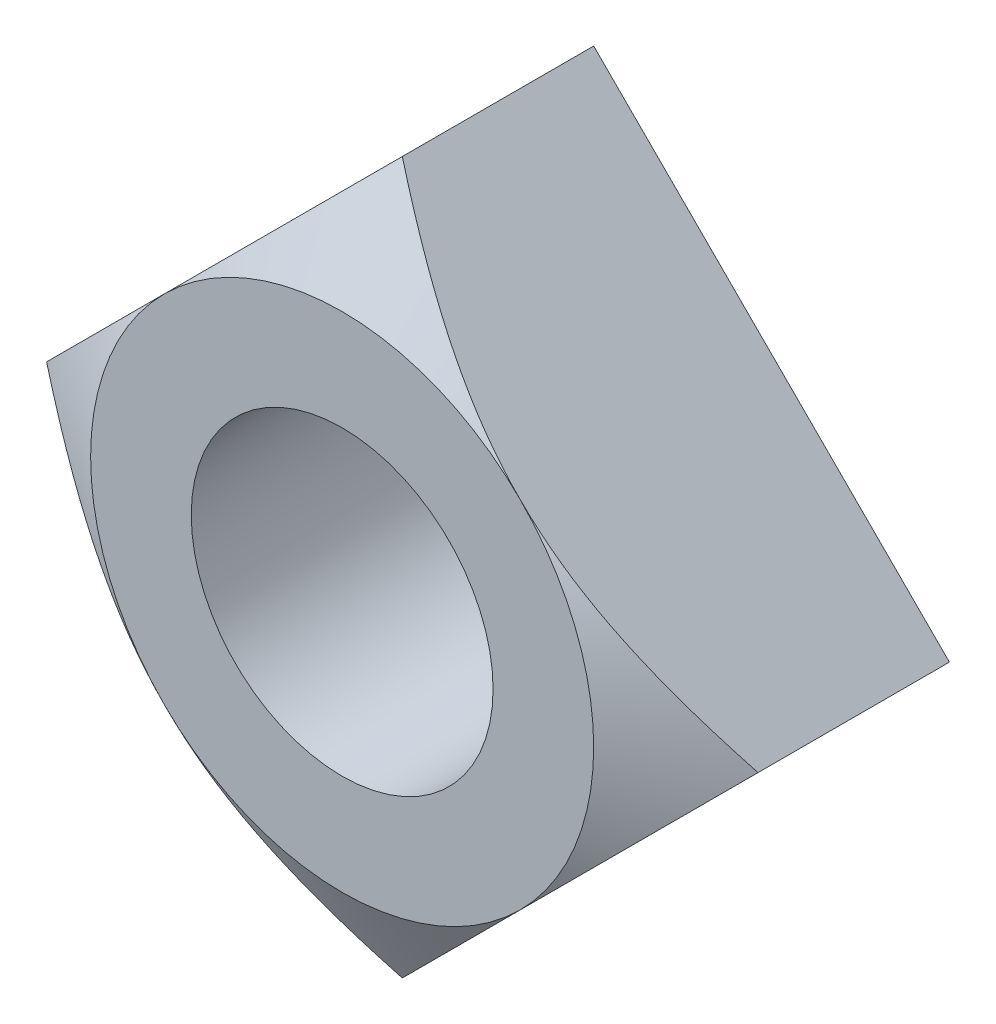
ISO-10303-21;
HEADER;
FILE_DESCRIPTION(('STEP AP214'),'2;1');
FILE_NAME('part.step','',(''),(''),'','','');
FILE_SCHEMA(('AUTOMOTIVE_DESIGN { 1 0 10303 214 1 1 1 1 }'));
ENDSEC;
DATA;
#1=APPLICATION_CONTEXT('core data for automotive mechanical design processes');
#2=APPLICATION_PROTOCOL_DEFINITION('international standard','automotive_design',2000,#1);
#3=PRODUCT_CONTEXT('',#1,'mechanical');
#4=PRODUCT('Part','Part','',(#3));
#5=PRODUCT_RELATED_PRODUCT_CATEGORY('part','',(#4));
#6=PRODUCT_DEFINITION_FORMATION('','',#4);
#7=PRODUCT_DEFINITION_CONTEXT('part definition',#1,'design');
#8=PRODUCT_DEFINITION('design','',#6,#7);
#9=PRODUCT_DEFINITION_SHAPE('','',#8);
#10=(LENGTH_UNIT() NAMED_UNIT(*) SI_UNIT(.MILLI.,.METRE.));
#11=(NAMED_UNIT(*) PLANE_ANGLE_UNIT() SI_UNIT($,.RADIAN.));
#12=(NAMED_UNIT(*) SI_UNIT($,.STERADIAN.) SOLID_ANGLE_UNIT());
#13=UNCERTAINTY_MEASURE_WITH_UNIT(LENGTH_MEASURE(1.E-05),#10,'distance_accuracy_value','');
#14=(GEOMETRIC_REPRESENTATION_CONTEXT(3) GLOBAL_UNCERTAINTY_ASSIGNED_CONTEXT((#13)) GLOBAL_UNIT_ASSIGNED_CONTEXT((#10,
#11,#12)) REPRESENTATION_CONTEXT('',''));
#15=CARTESIAN_POINT('',(0.,0.,0.));
#16=DIRECTION('',(0.,0.,1.));
#17=DIRECTION('',(1.,0.,0.));
#18=AXIS2_PLACEMENT_3D('',#15,#16,#17);
#19=CARTESIAN_POINT('',(7.07106781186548,0.,5.));
#20=DIRECTION('',(-0.707106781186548,-0.707106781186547,0.));
#21=DIRECTION('',(0.707106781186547,-0.707106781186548,0.));
#22=AXIS2_PLACEMENT_3D('',#19,#20,#21);
#23=PLANE('',#22);
#24=CARTESIAN_POINT('',(7.07126781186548,-0.000199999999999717,3.80415296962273));
#25=CARTESIAN_POINT('',(6.9510400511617,0.120027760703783,3.87354324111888));
#26=CARTESIAN_POINT('',(6.83037787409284,0.240689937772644,3.94146309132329));
#27=CARTESIAN_POINT('',(6.58801528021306,0.483052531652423,4.07366610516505));
#28=CARTESIAN_POINT('',(6.46631451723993,0.60475329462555,4.13794799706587));
#29=CARTESIAN_POINT('',(6.22103442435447,0.850033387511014,4.26251309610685));
#30=CARTESIAN_POINT('',(6.09744813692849,0.973619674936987,4.32276918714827));
#31=CARTESIAN_POINT('',(5.84905122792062,1.22201658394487,4.43789609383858));
#32=CARTESIAN_POINT('',(5.72424071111,1.34682710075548,4.49276736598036));
#33=CARTESIAN_POINT('',(5.3519958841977,1.71907192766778,4.64595794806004));
#34=CARTESIAN_POINT('',(5.10254757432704,1.96852023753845,4.73505891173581));
#35=CARTESIAN_POINT('',(4.72496087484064,2.34610693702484,4.84253496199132));
#36=CARTESIAN_POINT('',(4.5986637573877,2.47240405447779,4.87397845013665));
#37=CARTESIAN_POINT('',(4.34502777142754,2.72604004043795,4.92699158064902));
#38=CARTESIAN_POINT('',(4.2176890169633,2.85337879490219,4.94856228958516));
#39=CARTESIAN_POINT('',(3.98316712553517,3.08790068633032,4.97823190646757));
#40=CARTESIAN_POINT('',(3.87608617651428,3.19498163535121,4.98795489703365));
#41=CARTESIAN_POINT('',(3.66171063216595,3.40935717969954,4.99948200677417));
#42=CARTESIAN_POINT('',(3.5544160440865,3.51665176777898,5.00128639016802));
#43=CARTESIAN_POINT('',(3.3398620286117,3.73120578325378,4.99690940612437));
#44=CARTESIAN_POINT('',(3.23260263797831,3.83846517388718,4.99072449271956));
#45=CARTESIAN_POINT('',(3.01845153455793,4.05261627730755,4.97058283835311));
#46=CARTESIAN_POINT('',(2.91155982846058,4.15950798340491,4.95662595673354));
#47=CARTESIAN_POINT('',(2.69820552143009,4.3728622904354,4.92137535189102));
#48=CARTESIAN_POINT('',(2.59174394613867,4.47932386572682,4.90006931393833));
#49=CARTESIAN_POINT('',(2.37959311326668,4.69147469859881,4.85076125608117));
#50=CARTESIAN_POINT('',(2.27390397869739,4.7971638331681,4.82275819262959));
#51=CARTESIAN_POINT('',(1.95816176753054,5.11290604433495,4.72979705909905));
#52=CARTESIAN_POINT('',(1.74941382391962,5.32165398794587,4.65588347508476));
#53=CARTESIAN_POINT('',(1.41095701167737,5.66011080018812,4.52018241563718));
#54=CARTESIAN_POINT('',(1.28012490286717,5.79094290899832,4.46376784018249));
#55=CARTESIAN_POINT('',(1.01987516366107,6.05119264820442,4.34491432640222));
#56=CARTESIAN_POINT('',(0.890457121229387,6.1806106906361,4.28247719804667));
#57=CARTESIAN_POINT('',(0.633541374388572,6.43752643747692,4.15299769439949));
#58=CARTESIAN_POINT('',(0.506037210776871,6.56503060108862,4.08598070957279));
#59=CARTESIAN_POINT('',(0.252129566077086,6.8189382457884,3.94789582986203));
#60=CARTESIAN_POINT('',(0.125726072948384,6.94534173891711,3.87682797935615));
#61=CARTESIAN_POINT('',(-0.000199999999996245,7.07126781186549,3.80415296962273));
#62=B_SPLINE_CURVE_WITH_KNOTS('',3,(#24,#25,#26,#27,#28,#29,#30,#31,#32,#33,#34,#35,#36,#37,#38,
#39,#40,#41,#42,#43,#44,#45,#46,#47,#48,#49,#50,#51,#52,#53,#54,#55,#56,#57,#58,#59,#60,#61),
.UNSPECIFIED.,.F.,.F.,(4,2,2,2,2,2,2,2,2,2,2,2,2,2,2,2,2,2,4),(0.,0.550937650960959,
1.10206672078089,1.65659592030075,2.21107806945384,3.30106315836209,3.84491685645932,
4.38871178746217,4.84375903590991,5.29879110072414,5.75402519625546,6.20926753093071,
6.6652764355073,7.12135644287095,8.03343095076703,8.61365152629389,9.19369826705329,
9.77075583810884,10.3478070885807),.UNSPECIFIED.);
#63=CARTESIAN_POINT('',(7.07106781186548,0.,3.80426844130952));
#64=VERTEX_POINT('',#63);
#65=CARTESIAN_POINT('',(3.53553390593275,3.53553390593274,5.));
#66=VERTEX_POINT('',#65);
#67=EDGE_CURVE('E53',#64,#66,#62,.T.);
#68=ORIENTED_EDGE('',*,*,#67,.F.);
#69=DIRECTION('',(0.,0.,-1.));
#70=VECTOR('',#69,1.);
#71=CARTESIAN_POINT('',(7.07106781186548,0.,5.));
#72=LINE('',#71,#70);
#73=CARTESIAN_POINT('',(7.07106781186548,0.,0.));
#74=VERTEX_POINT('',#73);
#75=EDGE_CURVE('E180',#64,#74,#72,.T.);
#76=ORIENTED_EDGE('',*,*,#75,.T.);
#77=DIRECTION('',(-0.707106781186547,0.707106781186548,0.));
#78=VECTOR('',#77,1.);
#79=CARTESIAN_POINT('',(7.07106781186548,0.,0.));
#80=LINE('',#79,#78);
#81=CARTESIAN_POINT('',(0.,7.07106781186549,0.));
#82=VERTEX_POINT('',#81);
#83=EDGE_CURVE('E183',#74,#82,#80,.T.);
#84=ORIENTED_EDGE('',*,*,#83,.T.);
#85=DIRECTION('',(0.,0.,-1.));
#86=VECTOR('',#85,1.);
#87=CARTESIAN_POINT('',(0.,7.07106781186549,5.));
#88=LINE('',#87,#86);
#89=CARTESIAN_POINT('',(0.,7.07106781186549,3.80426844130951));
#90=VERTEX_POINT('',#89);
#91=EDGE_CURVE('E110',#90,#82,#88,.T.);
#92=ORIENTED_EDGE('',*,*,#91,.F.);
#93=EDGE_CURVE('E95',#66,#90,#62,.T.);
#94=ORIENTED_EDGE('',*,*,#93,.F.);
#95=EDGE_LOOP('',(#68,#76,#84,#92,#94));
#96=FACE_BOUND('',#95,.T.);
#97=ADVANCED_FACE('F36',(#96),#23,.F.);
#98=CARTESIAN_POINT('',(0.,7.07106781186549,5.));
#99=DIRECTION('',(0.707106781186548,-0.707106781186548,0.));
#100=DIRECTION('',(0.707106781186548,0.707106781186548,0.));
#101=AXIS2_PLACEMENT_3D('',#98,#99,#100);
#102=PLANE('',#101);
#103=CARTESIAN_POINT('',(0.000200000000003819,7.07126781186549,3.80415296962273));
#104=CARTESIAN_POINT('',(-0.120027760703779,6.9510400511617,3.87354324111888));
#105=CARTESIAN_POINT('',(-0.24068993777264,6.83037787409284,3.94146309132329));
#106=CARTESIAN_POINT('',(-0.483052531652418,6.58801528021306,4.07366610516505));
#107=CARTESIAN_POINT('',(-0.604753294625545,6.46631451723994,4.13794799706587));
#108=CARTESIAN_POINT('',(-0.85003338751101,6.22103442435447,4.26251309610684));
#109=CARTESIAN_POINT('',(-0.973619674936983,6.0974481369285,4.32276918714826));
#110=CARTESIAN_POINT('',(-1.22201658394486,5.84905122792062,4.43789609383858));
#111=CARTESIAN_POINT('',(-1.34682710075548,5.72424071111,4.49276736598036));
#112=CARTESIAN_POINT('',(-1.71907192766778,5.3519958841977,4.64595794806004));
#113=CARTESIAN_POINT('',(-1.96852023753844,5.10254757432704,4.73505891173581));
#114=CARTESIAN_POINT('',(-2.34610693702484,4.72496087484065,4.84253496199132));
#115=CARTESIAN_POINT('',(-2.47240405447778,4.5986637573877,4.87397845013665));
#116=CARTESIAN_POINT('',(-2.72604004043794,4.34502777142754,4.92699158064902));
#117=CARTESIAN_POINT('',(-2.85337879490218,4.2176890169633,4.94856228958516));
#118=CARTESIAN_POINT('',(-3.08790068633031,3.98316712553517,4.97823190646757));
#119=CARTESIAN_POINT('',(-3.1949816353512,3.87608617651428,4.98795489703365));
#120=CARTESIAN_POINT('',(-3.40935717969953,3.66171063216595,4.99948200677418));
#121=CARTESIAN_POINT('',(-3.51665176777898,3.55441604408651,5.00128639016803));
#122=CARTESIAN_POINT('',(-3.73120578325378,3.3398620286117,4.99690940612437));
#123=CARTESIAN_POINT('',(-3.83846517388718,3.23260263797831,4.99072449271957));
#124=CARTESIAN_POINT('',(-4.05261627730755,3.01845153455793,4.97058283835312));
#125=CARTESIAN_POINT('',(-4.1595079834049,2.91155982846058,4.95662595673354));
#126=CARTESIAN_POINT('',(-4.37286229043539,2.69820552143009,4.92137535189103));
#127=CARTESIAN_POINT('',(-4.47932386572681,2.59174394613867,4.90006931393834));
#128=CARTESIAN_POINT('',(-4.6914746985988,2.37959311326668,4.85076125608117));
#129=CARTESIAN_POINT('',(-4.79716383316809,2.27390397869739,4.8227581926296));
#130=CARTESIAN_POINT('',(-5.11290604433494,1.95816176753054,4.72979705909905));
#131=CARTESIAN_POINT('',(-5.32165398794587,1.74941382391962,4.65588347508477));
#132=CARTESIAN_POINT('',(-5.66011080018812,1.41095701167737,4.52018241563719));
#133=CARTESIAN_POINT('',(-5.79094290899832,1.28012490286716,4.46376784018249));
#134=CARTESIAN_POINT('',(-6.05119264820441,1.01987516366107,4.34491432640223));
#135=CARTESIAN_POINT('',(-6.1806106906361,0.890457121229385,4.28247719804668));
#136=CARTESIAN_POINT('',(-6.43752643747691,0.63354137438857,4.1529976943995));
#137=CARTESIAN_POINT('',(-6.56503060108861,0.50603721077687,4.0859807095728));
#138=CARTESIAN_POINT('',(-6.8189382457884,0.252129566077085,3.94789582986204));
#139=CARTESIAN_POINT('',(-6.9453417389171,0.125726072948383,3.87682797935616));
#140=CARTESIAN_POINT('',(-7.07126781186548,-0.000199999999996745,3.80415296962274));
#141=B_SPLINE_CURVE_WITH_KNOTS('',3,(#103,#104,#105,#106,#107,#108,#109,#110,#111,#112,#113,
#114,#115,#116,#117,#118,#119,#120,#121,#122,#123,#124,#125,#126,#127,#128,#129,#130,#131,#132,
#133,#134,#135,#136,#137,#138,#139,#140),.UNSPECIFIED.,.F.,.F.,(4,2,2,2,2,2,2,2,2,2,2,2,2,2,2,2,
2,2,4),(0.,0.550937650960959,1.10206672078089,1.65659592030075,2.21107806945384,3.3010631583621,
3.84491685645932,4.38871178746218,4.84375903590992,5.29879110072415,5.75402519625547,
6.20926753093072,6.66527643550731,7.12135644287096,8.03343095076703,8.6136515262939,
9.19369826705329,9.77075583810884,10.3478070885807),.UNSPECIFIED.);
#142=CARTESIAN_POINT('',(-3.53553390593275,3.53553390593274,5.));
#143=VERTEX_POINT('',#142);
#144=EDGE_CURVE('E89',#90,#143,#141,.T.);
#145=ORIENTED_EDGE('',*,*,#144,.F.);
#146=ORIENTED_EDGE('',*,*,#91,.T.);
#147=DIRECTION('',(-0.707106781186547,-0.707106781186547,0.));
#148=VECTOR('',#147,1.);
#149=CARTESIAN_POINT('',(0.,7.07106781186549,0.));
#150=LINE('',#149,#148);
#151=CARTESIAN_POINT('',(-7.07106781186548,0.,0.));
#152=VERTEX_POINT('',#151);
#153=EDGE_CURVE('E204',#82,#152,#150,.T.);
#154=ORIENTED_EDGE('',*,*,#153,.T.);
#155=DIRECTION('',(0.,0.,-1.));
#156=VECTOR('',#155,1.);
#157=CARTESIAN_POINT('',(-7.07106781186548,0.,5.));
#158=LINE('',#157,#156);
#159=CARTESIAN_POINT('',(-7.07106781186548,0.,3.80426844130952));
#160=VERTEX_POINT('',#159);
#161=EDGE_CURVE('E116',#160,#152,#158,.T.);
#162=ORIENTED_EDGE('',*,*,#161,.F.);
#163=EDGE_CURVE('E100',#143,#160,#141,.T.);
#164=ORIENTED_EDGE('',*,*,#163,.F.);
#165=EDGE_LOOP('',(#145,#146,#154,#162,#164));
#166=FACE_BOUND('',#165,.T.);
#167=ADVANCED_FACE('F114',(#166),#102,.F.);
#168=CARTESIAN_POINT('',(-7.07106781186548,0.,5.));
#169=DIRECTION('',(0.707106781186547,0.707106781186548,0.));
#170=DIRECTION('',(-0.707106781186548,0.707106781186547,0.));
#171=AXIS2_PLACEMENT_3D('',#168,#169,#170);
#172=PLANE('',#171);
#173=CARTESIAN_POINT('',(-7.07126781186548,0.000200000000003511,3.80415296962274));
#174=CARTESIAN_POINT('',(-6.9510400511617,-0.12002776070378,3.87354324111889));
#175=CARTESIAN_POINT('',(-6.83037787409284,-0.24068993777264,3.9414630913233));
#176=CARTESIAN_POINT('',(-6.58801528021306,-0.483052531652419,4.07366610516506));
#177=CARTESIAN_POINT('',(-6.46631451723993,-0.604753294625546,4.13794799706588));
#178=CARTESIAN_POINT('',(-6.22103442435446,-0.850033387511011,4.26251309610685));
#179=CARTESIAN_POINT('',(-6.09744813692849,-0.973619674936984,4.32276918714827));
#180=CARTESIAN_POINT('',(-5.84905122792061,-1.22201658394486,4.43789609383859));
#181=CARTESIAN_POINT('',(-5.72424071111,-1.34682710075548,4.49276736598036));
#182=CARTESIAN_POINT('',(-5.3519958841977,-1.71907192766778,4.64595794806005));
#183=CARTESIAN_POINT('',(-5.10254757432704,-1.96852023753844,4.73505891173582));
#184=CARTESIAN_POINT('',(-4.72496087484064,-2.34610693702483,4.84253496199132));
#185=CARTESIAN_POINT('',(-4.59866375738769,-2.47240405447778,4.87397845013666));
#186=CARTESIAN_POINT('',(-4.34502777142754,-2.72604004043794,4.92699158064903));
#187=CARTESIAN_POINT('',(-4.2176890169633,-2.85337879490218,4.94856228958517));
#188=CARTESIAN_POINT('',(-3.98316712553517,-3.08790068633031,4.97823190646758));
#189=CARTESIAN_POINT('',(-3.87608617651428,-3.1949816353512,4.98795489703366));
#190=CARTESIAN_POINT('',(-3.66171063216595,-3.40935717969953,4.99948200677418));
#191=CARTESIAN_POINT('',(-3.5544160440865,-3.51665176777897,5.00128639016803));
#192=CARTESIAN_POINT('',(-3.3398620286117,-3.73120578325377,4.99690940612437));
#193=CARTESIAN_POINT('',(-3.23260263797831,-3.83846517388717,4.99072449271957));
#194=CARTESIAN_POINT('',(-3.01845153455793,-4.05261627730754,4.97058283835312));
#195=CARTESIAN_POINT('',(-2.91155982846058,-4.15950798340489,4.95662595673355));
#196=CARTESIAN_POINT('',(-2.69820552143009,-4.37286229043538,4.92137535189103));
#197=CARTESIAN_POINT('',(-2.59174394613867,-4.4793238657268,4.90006931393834));
#198=CARTESIAN_POINT('',(-2.37959311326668,-4.6914746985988,4.85076125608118));
#199=CARTESIAN_POINT('',(-2.27390397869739,-4.79716383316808,4.82275819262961));
#200=CARTESIAN_POINT('',(-1.95816176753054,-5.11290604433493,4.72979705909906));
#201=CARTESIAN_POINT('',(-1.74941382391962,-5.32165398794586,4.65588347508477));
#202=CARTESIAN_POINT('',(-1.41095701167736,-5.66011080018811,4.52018241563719));
#203=CARTESIAN_POINT('',(-1.28012490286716,-5.79094290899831,4.4637678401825));
#204=CARTESIAN_POINT('',(-1.01987516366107,-6.0511926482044,4.34491432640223));
#205=CARTESIAN_POINT('',(-0.890457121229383,-6.18061069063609,4.28247719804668));
#206=CARTESIAN_POINT('',(-0.633541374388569,-6.4375264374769,4.15299769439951));
#207=CARTESIAN_POINT('',(-0.506037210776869,-6.5650306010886,4.0859807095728));
#208=CARTESIAN_POINT('',(-0.252129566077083,-6.81893824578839,3.94789582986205));
#209=CARTESIAN_POINT('',(-0.125726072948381,-6.94534173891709,3.87682797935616));
#210=CARTESIAN_POINT('',(0.00019999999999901,-7.07126781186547,3.80415296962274));
#211=B_SPLINE_CURVE_WITH_KNOTS('',3,(#173,#174,#175,#176,#177,#178,#179,#180,#181,#182,#183,
#184,#185,#186,#187,#188,#189,#190,#191,#192,#193,#194,#195,#196,#197,#198,#199,#200,#201,#202,
#203,#204,#205,#206,#207,#208,#209,#210),.UNSPECIFIED.,.F.,.F.,(4,2,2,2,2,2,2,2,2,2,2,2,2,2,2,2,
2,2,4),(0.,0.55093765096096,1.10206672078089,1.65659592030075,2.21107806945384,3.30106315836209,
3.84491685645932,4.38871178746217,4.84375903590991,5.29879110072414,5.75402519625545,
6.20926753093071,6.66527643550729,7.12135644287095,8.03343095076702,8.61365152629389,
9.19369826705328,9.77075583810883,10.3478070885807),.UNSPECIFIED.);
#212=CARTESIAN_POINT('',(-3.53553390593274,-3.53553390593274,5.));
#213=VERTEX_POINT('',#212);
#214=EDGE_CURVE('E106',#160,#213,#211,.T.);
#215=ORIENTED_EDGE('',*,*,#214,.F.);
#216=ORIENTED_EDGE('',*,*,#161,.T.);
#217=DIRECTION('',(0.707106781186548,-0.707106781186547,0.));
#218=VECTOR('',#217,1.);
#219=CARTESIAN_POINT('',(-7.07106781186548,0.,0.));
#220=LINE('',#219,#218);
#221=CARTESIAN_POINT('',(0.,-7.07106781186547,0.));
#222=VERTEX_POINT('',#221);
#223=EDGE_CURVE('E196',#152,#222,#220,.T.);
#224=ORIENTED_EDGE('',*,*,#223,.T.);
#225=DIRECTION('',(0.,0.,-1.));
#226=VECTOR('',#225,1.);
#227=CARTESIAN_POINT('',(0.,-7.07106781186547,5.));
#228=LINE('',#227,#226);
#229=CARTESIAN_POINT('',(0.,-7.07106781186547,3.80426844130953));
#230=VERTEX_POINT('',#229);
#231=EDGE_CURVE('E190',#230,#222,#228,.T.);
#232=ORIENTED_EDGE('',*,*,#231,.F.);
#233=EDGE_CURVE('E121',#213,#230,#211,.T.);
#234=ORIENTED_EDGE('',*,*,#233,.F.);
#235=EDGE_LOOP('',(#215,#216,#224,#232,#234));
#236=FACE_BOUND('',#235,.T.);
#237=ADVANCED_FACE('F166',(#236),#172,.F.);
#238=CARTESIAN_POINT('',(0.,-7.07106781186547,5.));
#239=DIRECTION('',(-0.707106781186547,0.707106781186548,0.));
#240=DIRECTION('',(-0.707106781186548,-0.707106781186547,0.));
#241=AXIS2_PLACEMENT_3D('',#238,#239,#240);
#242=PLANE('',#241);
#243=CARTESIAN_POINT('',(-0.000200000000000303,-7.07126781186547,3.80415296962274));
#244=CARTESIAN_POINT('',(0.120027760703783,-6.95104005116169,3.87354324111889));
#245=CARTESIAN_POINT('',(0.240689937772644,-6.83037787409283,3.9414630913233));
#246=CARTESIAN_POINT('',(0.483052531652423,-6.58801528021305,4.07366610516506));
#247=CARTESIAN_POINT('',(0.604753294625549,-6.46631451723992,4.13794799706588));
#248=CARTESIAN_POINT('',(0.850033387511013,-6.22103442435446,4.26251309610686));
#249=CARTESIAN_POINT('',(0.973619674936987,-6.09744813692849,4.32276918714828));
#250=CARTESIAN_POINT('',(1.22201658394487,-5.84905122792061,4.43789609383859));
#251=CARTESIAN_POINT('',(1.34682710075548,-5.72424071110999,4.49276736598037));
#252=CARTESIAN_POINT('',(1.71907192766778,-5.35199588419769,4.64595794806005));
#253=CARTESIAN_POINT('',(1.96852023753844,-5.10254757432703,4.73505891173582));
#254=CARTESIAN_POINT('',(2.34610693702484,-4.72496087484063,4.84253496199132));
#255=CARTESIAN_POINT('',(2.47240405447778,-4.59866375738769,4.87397845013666));
#256=CARTESIAN_POINT('',(2.72604004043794,-4.34502777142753,4.92699158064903));
#257=CARTESIAN_POINT('',(2.85337879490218,-4.21768901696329,4.94856228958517));
#258=CARTESIAN_POINT('',(3.08790068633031,-3.98316712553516,4.97823190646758));
#259=CARTESIAN_POINT('',(3.1949816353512,-3.87608617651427,4.98795489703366));
#260=CARTESIAN_POINT('',(3.40935717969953,-3.66171063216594,4.99948200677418));
#261=CARTESIAN_POINT('',(3.51665176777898,-3.5544160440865,5.00128639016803));
#262=CARTESIAN_POINT('',(3.73120578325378,-3.3398620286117,4.99690940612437));
#263=CARTESIAN_POINT('',(3.83846517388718,-3.2326026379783,4.99072449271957));
#264=CARTESIAN_POINT('',(4.05261627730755,-3.01845153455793,4.97058283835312));
#265=CARTESIAN_POINT('',(4.1595079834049,-2.91155982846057,4.95662595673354));
#266=CARTESIAN_POINT('',(4.37286229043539,-2.69820552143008,4.92137535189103));
#267=CARTESIAN_POINT('',(4.47932386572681,-2.59174394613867,4.90006931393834));
#268=CARTESIAN_POINT('',(4.69147469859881,-2.37959311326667,4.85076125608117));
#269=CARTESIAN_POINT('',(4.79716383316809,-2.27390397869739,4.8227581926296));
#270=CARTESIAN_POINT('',(5.11290604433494,-1.95816176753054,4.72979705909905));
#271=CARTESIAN_POINT('',(5.32165398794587,-1.74941382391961,4.65588347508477));
#272=CARTESIAN_POINT('',(5.66011080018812,-1.41095701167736,4.52018241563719));
#273=CARTESIAN_POINT('',(5.79094290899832,-1.28012490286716,4.46376784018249));
#274=CARTESIAN_POINT('',(6.05119264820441,-1.01987516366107,4.34491432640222));
#275=CARTESIAN_POINT('',(6.1806106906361,-0.890457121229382,4.28247719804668));
#276=CARTESIAN_POINT('',(6.43752643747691,-0.633541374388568,4.1529976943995));
#277=CARTESIAN_POINT('',(6.56503060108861,-0.506037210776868,4.08598070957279));
#278=CARTESIAN_POINT('',(6.8189382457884,-0.252129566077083,3.94789582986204));
#279=CARTESIAN_POINT('',(6.9453417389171,-0.125726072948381,3.87682797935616));
#280=CARTESIAN_POINT('',(7.07126781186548,0.000199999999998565,3.80415296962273));
#281=B_SPLINE_CURVE_WITH_KNOTS('',3,(#243,#244,#245,#246,#247,#248,#249,#250,#251,#252,#253,
#254,#255,#256,#257,#258,#259,#260,#261,#262,#263,#264,#265,#266,#267,#268,#269,#270,#271,#272,
#273,#274,#275,#276,#277,#278,#279,#280),.UNSPECIFIED.,.F.,.F.,(4,2,2,2,2,2,2,2,2,2,2,2,2,2,2,2,
2,2,4),(0.,0.55093765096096,1.10206672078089,1.65659592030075,2.21107806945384,3.30106315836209,
3.84491685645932,4.38871178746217,4.84375903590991,5.29879110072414,5.75402519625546,
6.20926753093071,6.6652764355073,7.12135644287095,8.03343095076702,8.61365152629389,
9.19369826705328,9.77075583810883,10.3478070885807),.UNSPECIFIED.);
#282=CARTESIAN_POINT('',(3.53553390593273,-3.53553390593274,5.));
#283=VERTEX_POINT('',#282);
#284=EDGE_CURVE('E160',#230,#283,#281,.T.);
#285=ORIENTED_EDGE('',*,*,#284,.F.);
#286=ORIENTED_EDGE('',*,*,#231,.T.);
#287=DIRECTION('',(0.707106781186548,0.707106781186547,0.));
#288=VECTOR('',#287,1.);
#289=CARTESIAN_POINT('',(0.,-7.07106781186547,0.));
#290=LINE('',#289,#288);
#291=EDGE_CURVE('E187',#222,#74,#290,.T.);
#292=ORIENTED_EDGE('',*,*,#291,.T.);
#293=ORIENTED_EDGE('',*,*,#75,.F.);
#294=EDGE_CURVE('E151',#283,#64,#281,.T.);
#295=ORIENTED_EDGE('',*,*,#294,.F.);
#296=EDGE_LOOP('',(#285,#286,#292,#293,#295));
#297=FACE_BOUND('',#296,.T.);
#298=ADVANCED_FACE('F162',(#297),#242,.F.);
#299=CARTESIAN_POINT('',(7.07106781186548,0.,0.));
#300=DIRECTION('',(0.,0.,-1.));
#301=DIRECTION('',(-1.,0.,0.));
#302=AXIS2_PLACEMENT_3D('',#299,#300,#301);
#303=PLANE('',#302);
#304=CARTESIAN_POINT('',(0.,0.,0.));
#305=DIRECTION('',(0.,0.,1.));
#306=DIRECTION('',(1.,0.,0.));
#307=AXIS2_PLACEMENT_3D('',#304,#305,#306);
#308=CIRCLE('',#307,3.);
#309=CARTESIAN_POINT('',(3.,0.,0.));
#310=VERTEX_POINT('',#309);
#311=EDGE_CURVE('E235',#310,#310,#308,.T.);
#312=ORIENTED_EDGE('',*,*,#311,.T.);
#313=EDGE_LOOP('',(#312));
#314=FACE_BOUND('',#313,.T.);
#315=ORIENTED_EDGE('',*,*,#83,.F.);
#316=ORIENTED_EDGE('',*,*,#291,.F.);
#317=ORIENTED_EDGE('',*,*,#223,.F.);
#318=ORIENTED_EDGE('',*,*,#153,.F.);
#319=EDGE_LOOP('',(#315,#316,#317,#318));
#320=FACE_BOUND('',#319,.T.);
#321=ADVANCED_FACE('F165',(#314,#320),#303,.T.);
#322=CARTESIAN_POINT('',(0.,0.,2.11324865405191));
#323=DIRECTION('',(0.,0.,-1.));
#324=DIRECTION('',(0.,1.,0.));
#325=AXIS2_PLACEMENT_3D('',#322,#323,#324);
#326=CONICAL_SURFACE('',#325,10.,1.0471975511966);
#327=ORIENTED_EDGE('',*,*,#163,.T.);
#328=ORIENTED_EDGE('',*,*,#214,.T.);
#329=CARTESIAN_POINT('',(0.,0.,5.));
#330=DIRECTION('',(0.,0.,-1.));
#331=DIRECTION('',(-1.,0.,0.));
#332=AXIS2_PLACEMENT_3D('',#329,#330,#331);
#333=CIRCLE('',#332,5.00000000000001);
#334=EDGE_CURVE('E40',#213,#143,#333,.T.);
#335=ORIENTED_EDGE('',*,*,#334,.T.);
#336=EDGE_LOOP('',(#327,#328,#335));
#337=FACE_BOUND('',#336,.T.);
#338=ADVANCED_FACE('F104',(#337),#326,.T.);
#339=ORIENTED_EDGE('',*,*,#233,.T.);
#340=ORIENTED_EDGE('',*,*,#284,.T.);
#341=EDGE_CURVE('E46',#283,#213,#333,.T.);
#342=ORIENTED_EDGE('',*,*,#341,.T.);
#343=EDGE_LOOP('',(#339,#340,#342));
#344=FACE_BOUND('',#343,.T.);
#345=ADVANCED_FACE('F146',(#344),#326,.T.);
#346=ORIENTED_EDGE('',*,*,#67,.T.);
#347=CARTESIAN_POINT('',(0.,0.,5.));
#348=DIRECTION('',(0.,0.,-1.));
#349=DIRECTION('',(0.,1.,0.));
#350=AXIS2_PLACEMENT_3D('',#347,#348,#349);
#351=CIRCLE('',#350,5.00000000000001);
#352=EDGE_CURVE('E112',#66,#283,#351,.T.);
#353=ORIENTED_EDGE('',*,*,#352,.T.);
#354=ORIENTED_EDGE('',*,*,#294,.T.);
#355=EDGE_LOOP('',(#346,#353,#354));
#356=FACE_BOUND('',#355,.T.);
#357=ADVANCED_FACE('F141',(#356),#326,.T.);
#358=ORIENTED_EDGE('',*,*,#93,.T.);
#359=ORIENTED_EDGE('',*,*,#144,.T.);
#360=EDGE_CURVE('E11',#143,#66,#333,.T.);
#361=ORIENTED_EDGE('',*,*,#360,.T.);
#362=EDGE_LOOP('',(#358,#359,#361));
#363=FACE_BOUND('',#362,.T.);
#364=ADVANCED_FACE('F91',(#363),#326,.T.);
#365=CARTESIAN_POINT('',(7.07106781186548,0.,5.));
#366=DIRECTION('',(0.,0.,-1.));
#367=DIRECTION('',(-1.,0.,0.));
#368=AXIS2_PLACEMENT_3D('',#365,#366,#367);
#369=PLANE('',#368);
#370=CARTESIAN_POINT('',(0.,0.,5.));
#371=DIRECTION('',(0.,0.,1.));
#372=DIRECTION('',(1.,0.,0.));
#373=AXIS2_PLACEMENT_3D('',#370,#371,#372);
#374=CIRCLE('',#373,3.);
#375=CARTESIAN_POINT('',(3.,0.,5.));
#376=VERTEX_POINT('',#375);
#377=EDGE_CURVE('E233',#376,#376,#374,.T.);
#378=ORIENTED_EDGE('',*,*,#377,.F.);
#379=EDGE_LOOP('',(#378));
#380=FACE_BOUND('',#379,.T.);
#381=ORIENTED_EDGE('',*,*,#360,.F.);
#382=ORIENTED_EDGE('',*,*,#334,.F.);
#383=ORIENTED_EDGE('',*,*,#341,.F.);
#384=ORIENTED_EDGE('',*,*,#352,.F.);
#385=EDGE_LOOP('',(#381,#382,#383,#384));
#386=FACE_BOUND('',#385,.T.);
#387=ADVANCED_FACE('F111',(#380,#386),#369,.F.);
#388=CARTESIAN_POINT('',(0.,0.,0.));
#389=DIRECTION('',(0.,0.,1.));
#390=DIRECTION('',(1.,0.,0.));
#391=AXIS2_PLACEMENT_3D('',#388,#389,#390);
#392=CYLINDRICAL_SURFACE('',#391,3.);
#393=ORIENTED_EDGE('',*,*,#311,.F.);
#394=EDGE_LOOP('',(#393));
#395=FACE_BOUND('',#394,.T.);
#396=ORIENTED_EDGE('',*,*,#377,.T.);
#397=EDGE_LOOP('',(#396));
#398=FACE_BOUND('',#397,.T.);
#399=ADVANCED_FACE('F147',(#395,#398),#392,.F.);
#400=CLOSED_SHELL('',(#97,#167,#237,#298,#321,#338,#345,#357,#364,#387,#399));
#401=MANIFOLD_SOLID_BREP('B2',#400);
#402=ADVANCED_BREP_SHAPE_REPRESENTATION('',(#18,#401),#14);
#403=SHAPE_DEFINITION_REPRESENTATION(#9,#402);
ENDSEC;
END-ISO-10303-21;
